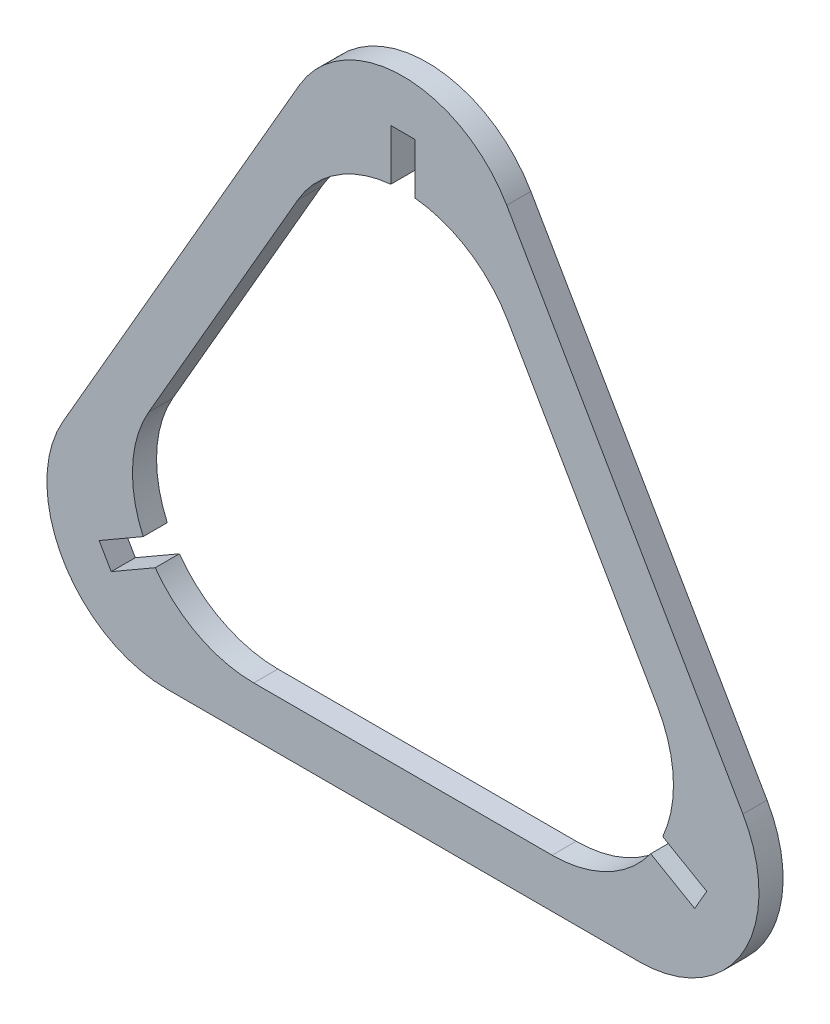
ISO-10303-21;
HEADER;
FILE_DESCRIPTION(('STEP AP214'),'2;1');
FILE_NAME('part.step','',(''),(''),'','','');
FILE_SCHEMA(('AUTOMOTIVE_DESIGN { 1 0 10303 214 1 1 1 1 }'));
ENDSEC;
DATA;
#1=APPLICATION_CONTEXT('core data for automotive mechanical design processes');
#2=APPLICATION_PROTOCOL_DEFINITION('international standard','automotive_design',2000,#1);
#3=PRODUCT_CONTEXT('',#1,'mechanical');
#4=PRODUCT('Part','Part','',(#3));
#5=PRODUCT_RELATED_PRODUCT_CATEGORY('part','',(#4));
#6=PRODUCT_DEFINITION_FORMATION('','',#4);
#7=PRODUCT_DEFINITION_CONTEXT('part definition',#1,'design');
#8=PRODUCT_DEFINITION('design','',#6,#7);
#9=PRODUCT_DEFINITION_SHAPE('','',#8);
#10=(LENGTH_UNIT() NAMED_UNIT(*) SI_UNIT(.MILLI.,.METRE.));
#11=(NAMED_UNIT(*) PLANE_ANGLE_UNIT() SI_UNIT($,.RADIAN.));
#12=(NAMED_UNIT(*) SI_UNIT($,.STERADIAN.) SOLID_ANGLE_UNIT());
#13=UNCERTAINTY_MEASURE_WITH_UNIT(LENGTH_MEASURE(1.E-05),#10,'distance_accuracy_value','');
#14=(GEOMETRIC_REPRESENTATION_CONTEXT(3) GLOBAL_UNCERTAINTY_ASSIGNED_CONTEXT((#13)) GLOBAL_UNIT_ASSIGNED_CONTEXT((#10,
#11,#12)) REPRESENTATION_CONTEXT('',''));
#15=CARTESIAN_POINT('',(0.,0.,0.));
#16=DIRECTION('',(0.,0.,1.));
#17=DIRECTION('',(1.,0.,0.));
#18=AXIS2_PLACEMENT_3D('',#15,#16,#17);
#19=CARTESIAN_POINT('',(24.7372055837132,-14.2820323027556,0.));
#20=DIRECTION('',(0.,0.,1.));
#21=DIRECTION('',(1.,0.,0.));
#22=AXIS2_PLACEMENT_3D('',#19,#20,#21);
#23=CYLINDRICAL_SURFACE('',#22,20.125);
#24=DIRECTION('',(0.,0.,1.));
#25=VECTOR('',#24,1.);
#26=CARTESIAN_POINT('',(43.0796886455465,-22.5626687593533,0.));
#27=LINE('',#26,#25);
#28=CARTESIAN_POINT('',(43.0796886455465,-22.5626687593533,0.));
#29=VERTEX_POINT('',#28);
#30=CARTESIAN_POINT('',(43.0796886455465,-22.5626687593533,4.));
#31=VERTEX_POINT('',#30);
#32=EDGE_CURVE('E227',#29,#31,#27,.T.);
#33=ORIENTED_EDGE('',*,*,#32,.T.);
#34=CARTESIAN_POINT('',(24.7372055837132,-14.2820323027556,4.));
#35=DIRECTION('',(0.,0.,1.));
#36=DIRECTION('',(1.,0.,0.));
#37=AXIS2_PLACEMENT_3D('',#34,#35,#36);
#38=CIRCLE('',#37,20.125);
#39=CARTESIAN_POINT('',(42.165966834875,-4.21953230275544,4.));
#40=VERTEX_POINT('',#39);
#41=EDGE_CURVE('E279',#40,#31,#38,.F.);
#42=ORIENTED_EDGE('',*,*,#41,.F.);
#43=DIRECTION('',(0.,0.,1.));
#44=VECTOR('',#43,1.);
#45=CARTESIAN_POINT('',(42.1659668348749,-4.21953230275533,0.));
#46=LINE('',#45,#44);
#47=CARTESIAN_POINT('',(42.1659668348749,-4.21953230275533,0.));
#48=VERTEX_POINT('',#47);
#49=EDGE_CURVE('E297',#48,#40,#46,.T.);
#50=ORIENTED_EDGE('',*,*,#49,.F.);
#51=CARTESIAN_POINT('',(24.7372055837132,-14.2820323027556,0.));
#52=DIRECTION('',(0.,0.,-1.));
#53=DIRECTION('',(-1.,0.,0.));
#54=AXIS2_PLACEMENT_3D('',#51,#52,#53);
#55=CIRCLE('',#54,20.125);
#56=EDGE_CURVE('E299',#48,#29,#55,.T.);
#57=ORIENTED_EDGE('',*,*,#56,.T.);
#58=EDGE_LOOP('',(#33,#42,#50,#57));
#59=FACE_BOUND('',#58,.T.);
#60=ADVANCED_FACE('F37',(#59),#23,.F.);
#61=CARTESIAN_POINT('',(-24.737205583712,-14.2820323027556,0.));
#62=DIRECTION('',(0.,0.,1.));
#63=DIRECTION('',(1.,0.,0.));
#64=AXIS2_PLACEMENT_3D('',#61,#62,#63);
#65=CYLINDRICAL_SURFACE('',#64,20.125);
#66=CARTESIAN_POINT('',(-24.737205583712,-14.2820323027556,0.));
#67=DIRECTION('',(0.,0.,-1.));
#68=DIRECTION('',(-1.,0.,0.));
#69=AXIS2_PLACEMENT_3D('',#66,#67,#68);
#70=CIRCLE('',#69,20.125);
#71=CARTESIAN_POINT('',(-41.0796886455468,-26.0267703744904,0.));
#72=VERTEX_POINT('',#71);
#73=CARTESIAN_POINT('',(-24.7372055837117,-34.4070323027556,0.));
#74=VERTEX_POINT('',#73);
#75=EDGE_CURVE('E310',#72,#74,#70,.F.);
#76=ORIENTED_EDGE('',*,*,#75,.F.);
#77=DIRECTION('',(0.,0.,1.));
#78=VECTOR('',#77,1.);
#79=CARTESIAN_POINT('',(-41.0796886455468,-26.0267703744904,0.));
#80=LINE('',#79,#78);
#81=CARTESIAN_POINT('',(-41.0796886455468,-26.0267703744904,4.));
#82=VERTEX_POINT('',#81);
#83=EDGE_CURVE('E253',#72,#82,#80,.T.);
#84=ORIENTED_EDGE('',*,*,#83,.T.);
#85=CARTESIAN_POINT('',(-24.737205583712,-14.2820323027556,4.));
#86=DIRECTION('',(0.,0.,1.));
#87=DIRECTION('',(1.,0.,0.));
#88=AXIS2_PLACEMENT_3D('',#85,#86,#87);
#89=CIRCLE('',#88,20.125);
#90=CARTESIAN_POINT('',(-24.7372055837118,-34.4070323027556,4.));
#91=VERTEX_POINT('',#90);
#92=EDGE_CURVE('E291',#82,#91,#89,.T.);
#93=ORIENTED_EDGE('',*,*,#92,.T.);
#94=DIRECTION('',(0.,0.,1.));
#95=VECTOR('',#94,1.);
#96=CARTESIAN_POINT('',(-24.7372055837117,-34.4070323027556,0.));
#97=LINE('',#96,#95);
#98=EDGE_CURVE('E285',#74,#91,#97,.T.);
#99=ORIENTED_EDGE('',*,*,#98,.F.);
#100=EDGE_LOOP('',(#76,#84,#93,#99));
#101=FACE_BOUND('',#100,.T.);
#102=ADVANCED_FACE('F433',(#101),#65,.F.);
#103=CARTESIAN_POINT('',(6.29704621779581E-13,28.5640646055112,0.));
#104=DIRECTION('',(0.,0.,1.));
#105=DIRECTION('',(1.,0.,0.));
#106=AXIS2_PLACEMENT_3D('',#103,#104,#105);
#107=CYLINDRICAL_SURFACE('',#106,20.125);
#108=CARTESIAN_POINT('',(6.29704621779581E-13,28.5640646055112,4.));
#109=DIRECTION('',(0.,0.,1.));
#110=DIRECTION('',(1.,0.,0.));
#111=AXIS2_PLACEMENT_3D('',#108,#109,#110);
#112=CIRCLE('',#111,20.125);
#113=CARTESIAN_POINT('',(17.4287612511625,38.626564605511,4.));
#114=VERTEX_POINT('',#113);
#115=CARTESIAN_POINT('',(2.,48.589439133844,4.));
#116=VERTEX_POINT('',#115);
#117=EDGE_CURVE('E233',#114,#116,#112,.T.);
#118=ORIENTED_EDGE('',*,*,#117,.T.);
#119=DIRECTION('',(0.,0.,1.));
#120=VECTOR('',#119,1.);
#121=CARTESIAN_POINT('',(2.,48.589439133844,0.));
#122=LINE('',#121,#120);
#123=CARTESIAN_POINT('',(2.,48.589439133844,0.));
#124=VERTEX_POINT('',#123);
#125=EDGE_CURVE('E323',#116,#124,#122,.F.);
#126=ORIENTED_EDGE('',*,*,#125,.T.);
#127=CARTESIAN_POINT('',(6.29704621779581E-13,28.5640646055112,0.));
#128=DIRECTION('',(0.,0.,-1.));
#129=DIRECTION('',(-1.,0.,0.));
#130=AXIS2_PLACEMENT_3D('',#127,#128,#129);
#131=CIRCLE('',#130,20.125);
#132=CARTESIAN_POINT('',(17.4287612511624,38.6265646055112,0.));
#133=VERTEX_POINT('',#132);
#134=EDGE_CURVE('E41',#133,#124,#131,.F.);
#135=ORIENTED_EDGE('',*,*,#134,.F.);
#136=DIRECTION('',(0.,0.,1.));
#137=VECTOR('',#136,1.);
#138=CARTESIAN_POINT('',(17.4287612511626,38.6265646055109,0.));
#139=LINE('',#138,#137);
#140=EDGE_CURVE('E319',#133,#114,#139,.T.);
#141=ORIENTED_EDGE('',*,*,#140,.T.);
#142=EDGE_LOOP('',(#118,#126,#135,#141));
#143=FACE_BOUND('',#142,.T.);
#144=ADVANCED_FACE('F406',(#143),#107,.F.);
#145=CARTESIAN_POINT('',(0.,0.,0.));
#146=DIRECTION('',(0.,0.,1.));
#147=DIRECTION('',(1.,0.,0.));
#148=AXIS2_PLACEMENT_3D('',#145,#146,#147);
#149=PLANE('',#148);
#150=DIRECTION('',(-0.5,0.866025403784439,0.));
#151=VECTOR('',#150,1.);
#152=CARTESIAN_POINT('',(56.3832172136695,-12.6778656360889,0.));
#153=LINE('',#152,#151);
#154=CARTESIAN_POINT('',(56.3832172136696,-12.6778656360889,0.));
#155=VERTEX_POINT('',#154);
#156=CARTESIAN_POINT('',(17.2122549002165,55.1682312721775,0.));
#157=VERTEX_POINT('',#156);
#158=EDGE_CURVE('E318',#155,#157,#153,.T.);
#159=ORIENTED_EDGE('',*,*,#158,.F.);
#160=CARTESIAN_POINT('',(39.1709623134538,-22.6153656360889,0.));
#161=DIRECTION('',(0.,0.,-1.));
#162=DIRECTION('',(-1.,0.,0.));
#163=AXIS2_PLACEMENT_3D('',#160,#161,#162);
#164=CIRCLE('',#163,19.875);
#165=CARTESIAN_POINT('',(39.1709623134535,-42.4903656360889,0.));
#166=VERTEX_POINT('',#165);
#167=EDGE_CURVE('E322',#155,#166,#164,.T.);
#168=ORIENTED_EDGE('',*,*,#167,.T.);
#169=DIRECTION('',(1.,0.,0.));
#170=VECTOR('',#169,1.);
#171=CARTESIAN_POINT('',(39.1709623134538,-42.4903656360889,0.));
#172=LINE('',#171,#170);
#173=CARTESIAN_POINT('',(-39.1709623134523,-42.4903656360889,0.));
#174=VERTEX_POINT('',#173);
#175=EDGE_CURVE('E336',#174,#166,#172,.T.);
#176=ORIENTED_EDGE('',*,*,#175,.F.);
#177=CARTESIAN_POINT('',(-39.1709623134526,-22.6153656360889,0.));
#178=DIRECTION('',(0.,0.,-1.));
#179=DIRECTION('',(-1.,0.,0.));
#180=AXIS2_PLACEMENT_3D('',#177,#178,#179);
#181=CIRCLE('',#180,19.875);
#182=CARTESIAN_POINT('',(-56.3832172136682,-12.6778656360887,0.));
#183=VERTEX_POINT('',#182);
#184=EDGE_CURVE('E340',#183,#174,#181,.F.);
#185=ORIENTED_EDGE('',*,*,#184,.F.);
#186=DIRECTION('',(-0.5,-0.866025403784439,0.));
#187=VECTOR('',#186,1.);
#188=CARTESIAN_POINT('',(-36.7977360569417,21.2451828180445,0.));
#189=LINE('',#188,#187);
#190=CARTESIAN_POINT('',(-17.2122549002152,55.1682312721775,0.));
#191=VERTEX_POINT('',#190);
#192=EDGE_CURVE('E344',#191,#183,#189,.T.);
#193=ORIENTED_EDGE('',*,*,#192,.F.);
#194=CARTESIAN_POINT('',(6.20597323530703E-13,45.2307312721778,0.));
#195=DIRECTION('',(0.,0.,-1.));
#196=DIRECTION('',(-1.,0.,0.));
#197=AXIS2_PLACEMENT_3D('',#194,#195,#196);
#198=CIRCLE('',#197,19.875);
#199=EDGE_CURVE('E348',#157,#191,#198,.F.);
#200=ORIENTED_EDGE('',*,*,#199,.F.);
#201=EDGE_LOOP('',(#159,#168,#176,#185,#193,#200));
#202=FACE_BOUND('',#201,.T.);
#203=DIRECTION('',(0.500000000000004,0.866025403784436,0.));
#204=VECTOR('',#203,1.);
#205=CARTESIAN_POINT('',(49.3828451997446,-28.5111989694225,0.));
#206=LINE('',#205,#204);
#207=CARTESIAN_POINT('',(48.3828451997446,-30.2432497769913,0.));
#208=VERTEX_POINT('',#207);
#209=CARTESIAN_POINT('',(50.3828451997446,-26.7791481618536,0.));
#210=VERTEX_POINT('',#209);
#211=EDGE_CURVE('E211',#208,#210,#206,.T.);
#212=ORIENTED_EDGE('',*,*,#211,.T.);
#213=DIRECTION('',(-0.866025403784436,0.500000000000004,0.));
#214=VECTOR('',#213,1.);
#215=CARTESIAN_POINT('',(1.00000000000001,1.73205080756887,0.));
#216=LINE('',#215,#214);
#217=EDGE_CURVE('E230',#210,#29,#216,.T.);
#218=ORIENTED_EDGE('',*,*,#217,.T.);
#219=ORIENTED_EDGE('',*,*,#56,.F.);
#220=DIRECTION('',(-0.5,0.866025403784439,0.));
#221=VECTOR('',#220,1.);
#222=CARTESIAN_POINT('',(42.165966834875,-4.21953230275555,0.));
#223=LINE('',#222,#221);
#224=EDGE_CURVE('E306',#48,#133,#223,.T.);
#225=ORIENTED_EDGE('',*,*,#224,.T.);
#226=ORIENTED_EDGE('',*,*,#134,.T.);
#227=DIRECTION('',(0.,1.,0.));
#228=VECTOR('',#227,1.);
#229=CARTESIAN_POINT('',(2.00000000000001,0.,0.));
#230=LINE('',#229,#228);
#231=CARTESIAN_POINT('',(2.,57.0223979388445,0.));
#232=VERTEX_POINT('',#231);
#233=EDGE_CURVE('E372',#124,#232,#230,.T.);
#234=ORIENTED_EDGE('',*,*,#233,.T.);
#235=DIRECTION('',(-1.,0.,0.));
#236=VECTOR('',#235,1.);
#237=CARTESIAN_POINT('',(0.,57.0223979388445,0.));
#238=LINE('',#237,#236);
#239=CARTESIAN_POINT('',(-2.,57.0223979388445,0.));
#240=VERTEX_POINT('',#239);
#241=EDGE_CURVE('E335',#232,#240,#238,.T.);
#242=ORIENTED_EDGE('',*,*,#241,.T.);
#243=DIRECTION('',(0.,-1.,0.));
#244=VECTOR('',#243,1.);
#245=CARTESIAN_POINT('',(-2.,0.,0.));
#246=LINE('',#245,#244);
#247=CARTESIAN_POINT('',(-2.,48.5894391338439,0.));
#248=VERTEX_POINT('',#247);
#249=EDGE_CURVE('E365',#240,#248,#246,.T.);
#250=ORIENTED_EDGE('',*,*,#249,.T.);
#251=CARTESIAN_POINT('',(-17.4287612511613,38.6265646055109,0.));
#252=VERTEX_POINT('',#251);
#253=EDGE_CURVE('E314',#248,#252,#131,.F.);
#254=ORIENTED_EDGE('',*,*,#253,.T.);
#255=DIRECTION('',(-0.5,-0.866025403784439,0.));
#256=VECTOR('',#255,1.);
#257=CARTESIAN_POINT('',(-29.7973640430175,17.2035161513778,0.));
#258=LINE('',#257,#256);
#259=CARTESIAN_POINT('',(-42.1659668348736,-4.21953230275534,0.));
#260=VERTEX_POINT('',#259);
#261=EDGE_CURVE('E311',#252,#260,#258,.T.);
#262=ORIENTED_EDGE('',*,*,#261,.T.);
#263=CARTESIAN_POINT('',(-43.0796886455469,-22.5626687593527,0.));
#264=VERTEX_POINT('',#263);
#265=EDGE_CURVE('E307',#260,#264,#70,.F.);
#266=ORIENTED_EDGE('',*,*,#265,.T.);
#267=DIRECTION('',(-0.866025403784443,-0.499999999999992,0.));
#268=VECTOR('',#267,1.);
#269=CARTESIAN_POINT('',(-0.999999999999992,1.7320508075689,0.));
#270=LINE('',#269,#268);
#271=CARTESIAN_POINT('',(-50.382845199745,-26.7791481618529,0.));
#272=VERTEX_POINT('',#271);
#273=EDGE_CURVE('E240',#264,#272,#270,.T.);
#274=ORIENTED_EDGE('',*,*,#273,.T.);
#275=DIRECTION('',(0.499999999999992,-0.866025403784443,0.));
#276=VECTOR('',#275,1.);
#277=CARTESIAN_POINT('',(-49.382845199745,-28.5111989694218,0.));
#278=LINE('',#277,#276);
#279=CARTESIAN_POINT('',(-48.382845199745,-30.2432497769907,0.));
#280=VERTEX_POINT('',#279);
#281=EDGE_CURVE('E248',#272,#280,#278,.T.);
#282=ORIENTED_EDGE('',*,*,#281,.T.);
#283=DIRECTION('',(0.866025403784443,0.499999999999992,0.));
#284=VECTOR('',#283,1.);
#285=CARTESIAN_POINT('',(0.999999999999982,-1.73205080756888,0.));
#286=LINE('',#285,#284);
#287=EDGE_CURVE('E256',#280,#72,#286,.T.);
#288=ORIENTED_EDGE('',*,*,#287,.T.);
#289=ORIENTED_EDGE('',*,*,#75,.T.);
#290=DIRECTION('',(1.,0.,0.));
#291=VECTOR('',#290,1.);
#292=CARTESIAN_POINT('',(24.7372055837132,-34.4070323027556,0.));
#293=LINE('',#292,#291);
#294=CARTESIAN_POINT('',(24.7372055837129,-34.4070323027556,0.));
#295=VERTEX_POINT('',#294);
#296=EDGE_CURVE('E303',#74,#295,#293,.T.);
#297=ORIENTED_EDGE('',*,*,#296,.T.);
#298=CARTESIAN_POINT('',(41.0796886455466,-26.0267703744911,0.));
#299=VERTEX_POINT('',#298);
#300=EDGE_CURVE('E302',#299,#295,#55,.T.);
#301=ORIENTED_EDGE('',*,*,#300,.F.);
#302=DIRECTION('',(0.866025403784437,-0.500000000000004,0.));
#303=VECTOR('',#302,1.);
#304=CARTESIAN_POINT('',(-1.00000000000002,-1.73205080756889,0.));
#305=LINE('',#304,#303);
#306=EDGE_CURVE('E213',#299,#208,#305,.T.);
#307=ORIENTED_EDGE('',*,*,#306,.T.);
#308=EDGE_LOOP('',(#212,#218,#219,#225,#226,#234,#242,#250,#254,#262,#266,#274,#282,#288,#289,
#297,#301,#307));
#309=FACE_BOUND('',#308,.T.);
#310=ADVANCED_FACE('F39',(#202,#309),#149,.F.);
#311=DIRECTION('',(0.,0.,1.));
#312=VECTOR('',#311,1.);
#313=CARTESIAN_POINT('',(41.0796886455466,-26.0267703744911,0.));
#314=LINE('',#313,#312);
#315=CARTESIAN_POINT('',(41.0796886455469,-26.0267703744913,4.));
#316=VERTEX_POINT('',#315);
#317=EDGE_CURVE('E62',#316,#299,#314,.F.);
#318=ORIENTED_EDGE('',*,*,#317,.T.);
#319=ORIENTED_EDGE('',*,*,#300,.T.);
#320=DIRECTION('',(0.,0.,1.));
#321=VECTOR('',#320,1.);
#322=CARTESIAN_POINT('',(24.7372055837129,-34.4070323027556,0.));
#323=LINE('',#322,#321);
#324=CARTESIAN_POINT('',(24.7372055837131,-34.4070323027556,4.));
#325=VERTEX_POINT('',#324);
#326=EDGE_CURVE('E286',#295,#325,#323,.T.);
#327=ORIENTED_EDGE('',*,*,#326,.T.);
#328=EDGE_CURVE('E281',#316,#325,#38,.F.);
#329=ORIENTED_EDGE('',*,*,#328,.F.);
#330=EDGE_LOOP('',(#318,#319,#327,#329));
#331=FACE_BOUND('',#330,.T.);
#332=ADVANCED_FACE('F436',(#331),#23,.F.);
#333=CARTESIAN_POINT('',(24.7372055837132,-34.4070323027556,0.));
#334=DIRECTION('',(0.,-1.,0.));
#335=DIRECTION('',(1.,0.,0.));
#336=AXIS2_PLACEMENT_3D('',#333,#334,#335);
#337=PLANE('',#336);
#338=DIRECTION('',(1.,0.,0.));
#339=VECTOR('',#338,1.);
#340=CARTESIAN_POINT('',(24.7372055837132,-34.4070323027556,4.));
#341=LINE('',#340,#339);
#342=EDGE_CURVE('E282',#91,#325,#341,.T.);
#343=ORIENTED_EDGE('',*,*,#342,.T.);
#344=ORIENTED_EDGE('',*,*,#326,.F.);
#345=ORIENTED_EDGE('',*,*,#296,.F.);
#346=ORIENTED_EDGE('',*,*,#98,.T.);
#347=EDGE_LOOP('',(#343,#344,#345,#346));
#348=FACE_BOUND('',#347,.T.);
#349=ADVANCED_FACE('F445',(#348),#337,.F.);
#350=CARTESIAN_POINT('',(-42.1659668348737,-4.21953230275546,4.));
#351=VERTEX_POINT('',#350);
#352=CARTESIAN_POINT('',(-43.0796886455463,-22.5626687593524,4.));
#353=VERTEX_POINT('',#352);
#354=EDGE_CURVE('E287',#351,#353,#89,.T.);
#355=ORIENTED_EDGE('',*,*,#354,.T.);
#356=DIRECTION('',(0.,0.,1.));
#357=VECTOR('',#356,1.);
#358=CARTESIAN_POINT('',(-43.0796886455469,-22.5626687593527,0.));
#359=LINE('',#358,#357);
#360=EDGE_CURVE('E54',#353,#264,#359,.F.);
#361=ORIENTED_EDGE('',*,*,#360,.T.);
#362=ORIENTED_EDGE('',*,*,#265,.F.);
#363=DIRECTION('',(0.,0.,1.));
#364=VECTOR('',#363,1.);
#365=CARTESIAN_POINT('',(-42.1659668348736,-4.21953230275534,0.));
#366=LINE('',#365,#364);
#367=EDGE_CURVE('E290',#260,#351,#366,.T.);
#368=ORIENTED_EDGE('',*,*,#367,.T.);
#369=EDGE_LOOP('',(#355,#361,#362,#368));
#370=FACE_BOUND('',#369,.T.);
#371=ADVANCED_FACE('F399',(#370),#65,.F.);
#372=CARTESIAN_POINT('',(-29.7973640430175,17.2035161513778,0.));
#373=DIRECTION('',(-0.866025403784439,0.5,0.));
#374=DIRECTION('',(-0.5,-0.866025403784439,0.));
#375=AXIS2_PLACEMENT_3D('',#372,#373,#374);
#376=PLANE('',#375);
#377=DIRECTION('',(-0.5,-0.866025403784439,0.));
#378=VECTOR('',#377,1.);
#379=CARTESIAN_POINT('',(-29.7973640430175,17.2035161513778,4.));
#380=LINE('',#379,#378);
#381=CARTESIAN_POINT('',(-17.4287612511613,38.626564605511,4.));
#382=VERTEX_POINT('',#381);
#383=EDGE_CURVE('E292',#382,#351,#380,.T.);
#384=ORIENTED_EDGE('',*,*,#383,.T.);
#385=ORIENTED_EDGE('',*,*,#367,.F.);
#386=ORIENTED_EDGE('',*,*,#261,.F.);
#387=DIRECTION('',(0.,0.,1.));
#388=VECTOR('',#387,1.);
#389=CARTESIAN_POINT('',(-17.4287612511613,38.6265646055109,0.));
#390=LINE('',#389,#388);
#391=EDGE_CURVE('E294',#252,#382,#390,.T.);
#392=ORIENTED_EDGE('',*,*,#391,.T.);
#393=EDGE_LOOP('',(#384,#385,#386,#392));
#394=FACE_BOUND('',#393,.T.);
#395=ADVANCED_FACE('F395',(#394),#376,.F.);
#396=ORIENTED_EDGE('',*,*,#253,.F.);
#397=DIRECTION('',(0.,0.,1.));
#398=VECTOR('',#397,1.);
#399=CARTESIAN_POINT('',(-2.,48.5894391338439,0.));
#400=LINE('',#399,#398);
#401=CARTESIAN_POINT('',(-2.,48.5894391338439,4.));
#402=VERTEX_POINT('',#401);
#403=EDGE_CURVE('E326',#248,#402,#400,.T.);
#404=ORIENTED_EDGE('',*,*,#403,.T.);
#405=EDGE_CURVE('E298',#402,#382,#112,.T.);
#406=ORIENTED_EDGE('',*,*,#405,.T.);
#407=ORIENTED_EDGE('',*,*,#391,.F.);
#408=EDGE_LOOP('',(#396,#404,#406,#407));
#409=FACE_BOUND('',#408,.T.);
#410=ADVANCED_FACE('F390',(#409),#107,.F.);
#411=CARTESIAN_POINT('',(42.165966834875,-4.21953230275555,0.));
#412=DIRECTION('',(0.866025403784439,0.5,0.));
#413=DIRECTION('',(-0.5,0.866025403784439,0.));
#414=AXIS2_PLACEMENT_3D('',#411,#412,#413);
#415=PLANE('',#414);
#416=DIRECTION('',(-0.5,0.866025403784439,0.));
#417=VECTOR('',#416,1.);
#418=CARTESIAN_POINT('',(42.165966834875,-4.21953230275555,4.));
#419=LINE('',#418,#417);
#420=EDGE_CURVE('E295',#40,#114,#419,.T.);
#421=ORIENTED_EDGE('',*,*,#420,.T.);
#422=ORIENTED_EDGE('',*,*,#140,.F.);
#423=ORIENTED_EDGE('',*,*,#224,.F.);
#424=ORIENTED_EDGE('',*,*,#49,.T.);
#425=EDGE_LOOP('',(#421,#422,#423,#424));
#426=FACE_BOUND('',#425,.T.);
#427=ADVANCED_FACE('F408',(#426),#415,.F.);
#428=CARTESIAN_POINT('',(56.3832172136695,-12.6778656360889,0.));
#429=DIRECTION('',(0.866025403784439,0.5,0.));
#430=DIRECTION('',(-0.5,0.866025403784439,0.));
#431=AXIS2_PLACEMENT_3D('',#428,#429,#430);
#432=PLANE('',#431);
#433=DIRECTION('',(0.,0.,1.));
#434=VECTOR('',#433,1.);
#435=CARTESIAN_POINT('',(56.3832172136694,-12.6778656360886,0.));
#436=LINE('',#435,#434);
#437=CARTESIAN_POINT('',(56.3832172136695,-12.6778656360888,4.));
#438=VERTEX_POINT('',#437);
#439=EDGE_CURVE('E261',#155,#438,#436,.T.);
#440=ORIENTED_EDGE('',*,*,#439,.F.);
#441=ORIENTED_EDGE('',*,*,#158,.T.);
#442=DIRECTION('',(0.,0.,1.));
#443=VECTOR('',#442,1.);
#444=CARTESIAN_POINT('',(17.2122549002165,55.1682312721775,0.));
#445=LINE('',#444,#443);
#446=CARTESIAN_POINT('',(17.2122549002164,55.1682312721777,4.));
#447=VERTEX_POINT('',#446);
#448=EDGE_CURVE('E351',#157,#447,#445,.T.);
#449=ORIENTED_EDGE('',*,*,#448,.T.);
#450=DIRECTION('',(-0.5,0.866025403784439,0.));
#451=VECTOR('',#450,1.);
#452=CARTESIAN_POINT('',(56.3832172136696,-12.6778656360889,4.));
#453=LINE('',#452,#451);
#454=EDGE_CURVE('E276',#438,#447,#453,.T.);
#455=ORIENTED_EDGE('',*,*,#454,.F.);
#456=EDGE_LOOP('',(#440,#441,#449,#455));
#457=FACE_BOUND('',#456,.T.);
#458=ADVANCED_FACE('F485',(#457),#432,.T.);
#459=CARTESIAN_POINT('',(6.20597323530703E-13,45.2307312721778,0.));
#460=DIRECTION('',(0.,0.,1.));
#461=DIRECTION('',(1.,0.,0.));
#462=AXIS2_PLACEMENT_3D('',#459,#460,#461);
#463=CYLINDRICAL_SURFACE('',#462,19.875);
#464=ORIENTED_EDGE('',*,*,#448,.F.);
#465=ORIENTED_EDGE('',*,*,#199,.T.);
#466=DIRECTION('',(0.,0.,1.));
#467=VECTOR('',#466,1.);
#468=CARTESIAN_POINT('',(-17.2122549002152,55.1682312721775,0.));
#469=LINE('',#468,#467);
#470=CARTESIAN_POINT('',(-17.2122549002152,55.1682312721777,4.));
#471=VERTEX_POINT('',#470);
#472=EDGE_CURVE('E347',#191,#471,#469,.T.);
#473=ORIENTED_EDGE('',*,*,#472,.T.);
#474=CARTESIAN_POINT('',(6.20597323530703E-13,45.2307312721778,4.));
#475=DIRECTION('',(0.,0.,1.));
#476=DIRECTION('',(1.,0.,0.));
#477=AXIS2_PLACEMENT_3D('',#474,#475,#476);
#478=CIRCLE('',#477,19.875);
#479=EDGE_CURVE('E273',#447,#471,#478,.T.);
#480=ORIENTED_EDGE('',*,*,#479,.F.);
#481=EDGE_LOOP('',(#464,#465,#473,#480));
#482=FACE_BOUND('',#481,.T.);
#483=ADVANCED_FACE('F515',(#482),#463,.T.);
#484=CARTESIAN_POINT('',(-36.7977360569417,21.2451828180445,0.));
#485=DIRECTION('',(-0.866025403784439,0.5,0.));
#486=DIRECTION('',(-0.5,-0.866025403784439,0.));
#487=AXIS2_PLACEMENT_3D('',#484,#485,#486);
#488=PLANE('',#487);
#489=ORIENTED_EDGE('',*,*,#472,.F.);
#490=ORIENTED_EDGE('',*,*,#192,.T.);
#491=DIRECTION('',(0.,0.,1.));
#492=VECTOR('',#491,1.);
#493=CARTESIAN_POINT('',(-56.3832172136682,-12.6778656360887,0.));
#494=LINE('',#493,#492);
#495=CARTESIAN_POINT('',(-56.3832172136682,-12.6778656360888,4.));
#496=VERTEX_POINT('',#495);
#497=EDGE_CURVE('E343',#183,#496,#494,.T.);
#498=ORIENTED_EDGE('',*,*,#497,.T.);
#499=DIRECTION('',(-0.5,-0.866025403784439,0.));
#500=VECTOR('',#499,1.);
#501=CARTESIAN_POINT('',(-17.2122549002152,55.1682312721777,4.));
#502=LINE('',#501,#500);
#503=EDGE_CURVE('E270',#471,#496,#502,.T.);
#504=ORIENTED_EDGE('',*,*,#503,.F.);
#505=EDGE_LOOP('',(#489,#490,#498,#504));
#506=FACE_BOUND('',#505,.T.);
#507=ADVANCED_FACE('F523',(#506),#488,.T.);
#508=CARTESIAN_POINT('',(-39.1709623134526,-22.6153656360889,0.));
#509=DIRECTION('',(0.,0.,1.));
#510=DIRECTION('',(1.,0.,0.));
#511=AXIS2_PLACEMENT_3D('',#508,#509,#510);
#512=CYLINDRICAL_SURFACE('',#511,19.875);
#513=ORIENTED_EDGE('',*,*,#497,.F.);
#514=ORIENTED_EDGE('',*,*,#184,.T.);
#515=DIRECTION('',(0.,0.,1.));
#516=VECTOR('',#515,1.);
#517=CARTESIAN_POINT('',(-39.1709623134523,-42.4903656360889,0.));
#518=LINE('',#517,#516);
#519=CARTESIAN_POINT('',(-39.1709623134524,-42.4903656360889,4.));
#520=VERTEX_POINT('',#519);
#521=EDGE_CURVE('E339',#174,#520,#518,.T.);
#522=ORIENTED_EDGE('',*,*,#521,.T.);
#523=CARTESIAN_POINT('',(-39.1709623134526,-22.6153656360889,4.));
#524=DIRECTION('',(0.,0.,1.));
#525=DIRECTION('',(1.,0.,0.));
#526=AXIS2_PLACEMENT_3D('',#523,#524,#525);
#527=CIRCLE('',#526,19.875);
#528=EDGE_CURVE('E267',#496,#520,#527,.T.);
#529=ORIENTED_EDGE('',*,*,#528,.F.);
#530=EDGE_LOOP('',(#513,#514,#522,#529));
#531=FACE_BOUND('',#530,.T.);
#532=ADVANCED_FACE('F532',(#531),#512,.T.);
#533=CARTESIAN_POINT('',(39.1709623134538,-42.4903656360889,0.));
#534=DIRECTION('',(0.,-1.,0.));
#535=DIRECTION('',(1.,0.,0.));
#536=AXIS2_PLACEMENT_3D('',#533,#534,#535);
#537=PLANE('',#536);
#538=ORIENTED_EDGE('',*,*,#521,.F.);
#539=ORIENTED_EDGE('',*,*,#175,.T.);
#540=DIRECTION('',(0.,0.,1.));
#541=VECTOR('',#540,1.);
#542=CARTESIAN_POINT('',(39.1709623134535,-42.4903656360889,0.));
#543=LINE('',#542,#541);
#544=CARTESIAN_POINT('',(39.1709623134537,-42.4903656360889,4.));
#545=VERTEX_POINT('',#544);
#546=EDGE_CURVE('E262',#166,#545,#543,.T.);
#547=ORIENTED_EDGE('',*,*,#546,.T.);
#548=DIRECTION('',(1.,0.,0.));
#549=VECTOR('',#548,1.);
#550=CARTESIAN_POINT('',(0.,-42.4903656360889,4.));
#551=LINE('',#550,#549);
#552=EDGE_CURVE('E263',#520,#545,#551,.T.);
#553=ORIENTED_EDGE('',*,*,#552,.F.);
#554=EDGE_LOOP('',(#538,#539,#547,#553));
#555=FACE_BOUND('',#554,.T.);
#556=ADVANCED_FACE('F541',(#555),#537,.T.);
#557=CARTESIAN_POINT('',(39.1709623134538,-22.6153656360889,0.));
#558=DIRECTION('',(0.,0.,1.));
#559=DIRECTION('',(1.,0.,0.));
#560=AXIS2_PLACEMENT_3D('',#557,#558,#559);
#561=CYLINDRICAL_SURFACE('',#560,19.875);
#562=CARTESIAN_POINT('',(39.1709623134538,-22.6153656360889,4.));
#563=DIRECTION('',(0.,0.,1.));
#564=DIRECTION('',(1.,0.,0.));
#565=AXIS2_PLACEMENT_3D('',#562,#563,#564);
#566=CIRCLE('',#565,19.875);
#567=EDGE_CURVE('E259',#438,#545,#566,.F.);
#568=ORIENTED_EDGE('',*,*,#567,.T.);
#569=ORIENTED_EDGE('',*,*,#546,.F.);
#570=ORIENTED_EDGE('',*,*,#167,.F.);
#571=ORIENTED_EDGE('',*,*,#439,.T.);
#572=EDGE_LOOP('',(#568,#569,#570,#571));
#573=FACE_BOUND('',#572,.T.);
#574=ADVANCED_FACE('F428',(#573),#561,.T.);
#575=CARTESIAN_POINT('',(0.,0.,4.));
#576=DIRECTION('',(0.,0.,1.));
#577=DIRECTION('',(1.,0.,0.));
#578=AXIS2_PLACEMENT_3D('',#575,#576,#577);
#579=PLANE('',#578);
#580=DIRECTION('',(-0.866025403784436,0.500000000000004,0.));
#581=VECTOR('',#580,1.);
#582=CARTESIAN_POINT('',(50.2745920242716,-26.7166481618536,4.));
#583=LINE('',#582,#581);
#584=CARTESIAN_POINT('',(50.3828451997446,-26.7791481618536,4.));
#585=VERTEX_POINT('',#584);
#586=EDGE_CURVE('E219',#585,#31,#583,.T.);
#587=ORIENTED_EDGE('',*,*,#586,.F.);
#588=DIRECTION('',(-0.500000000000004,-0.866025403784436,0.));
#589=VECTOR('',#588,1.);
#590=CARTESIAN_POINT('',(50.3203451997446,-26.8874013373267,4.));
#591=LINE('',#590,#589);
#592=CARTESIAN_POINT('',(48.3828451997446,-30.2432497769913,4.));
#593=VERTEX_POINT('',#592);
#594=EDGE_CURVE('E208',#593,#585,#591,.F.);
#595=ORIENTED_EDGE('',*,*,#594,.F.);
#596=DIRECTION('',(0.866025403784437,-0.500000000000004,0.));
#597=VECTOR('',#596,1.);
#598=CARTESIAN_POINT('',(-1.00000000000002,-1.73205080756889,4.));
#599=LINE('',#598,#597);
#600=EDGE_CURVE('E197',#316,#593,#599,.T.);
#601=ORIENTED_EDGE('',*,*,#600,.F.);
#602=ORIENTED_EDGE('',*,*,#328,.T.);
#603=ORIENTED_EDGE('',*,*,#342,.F.);
#604=ORIENTED_EDGE('',*,*,#92,.F.);
#605=DIRECTION('',(0.866025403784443,0.499999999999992,0.));
#606=VECTOR('',#605,1.);
#607=CARTESIAN_POINT('',(-48.2745920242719,-30.1807497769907,4.));
#608=LINE('',#607,#606);
#609=CARTESIAN_POINT('',(-48.382845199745,-30.2432497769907,4.));
#610=VERTEX_POINT('',#609);
#611=EDGE_CURVE('E251',#610,#82,#608,.T.);
#612=ORIENTED_EDGE('',*,*,#611,.F.);
#613=DIRECTION('',(-0.499999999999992,0.866025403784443,0.));
#614=VECTOR('',#613,1.);
#615=CARTESIAN_POINT('',(-48.445345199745,-30.1349966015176,4.));
#616=LINE('',#615,#614);
#617=CARTESIAN_POINT('',(-50.382845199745,-26.7791481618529,4.));
#618=VERTEX_POINT('',#617);
#619=EDGE_CURVE('E243',#618,#610,#616,.F.);
#620=ORIENTED_EDGE('',*,*,#619,.F.);
#621=DIRECTION('',(-0.866025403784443,-0.499999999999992,0.));
#622=VECTOR('',#621,1.);
#623=CARTESIAN_POINT('',(-0.999999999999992,1.7320508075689,4.));
#624=LINE('',#623,#622);
#625=EDGE_CURVE('E235',#353,#618,#624,.T.);
#626=ORIENTED_EDGE('',*,*,#625,.F.);
#627=ORIENTED_EDGE('',*,*,#354,.F.);
#628=ORIENTED_EDGE('',*,*,#383,.F.);
#629=ORIENTED_EDGE('',*,*,#405,.F.);
#630=DIRECTION('',(0.,-1.,0.));
#631=VECTOR('',#630,1.);
#632=CARTESIAN_POINT('',(-2.,56.8973979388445,4.));
#633=LINE('',#632,#631);
#634=CARTESIAN_POINT('',(-2.,57.0223979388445,4.));
#635=VERTEX_POINT('',#634);
#636=EDGE_CURVE('E379',#635,#402,#633,.T.);
#637=ORIENTED_EDGE('',*,*,#636,.F.);
#638=DIRECTION('',(1.,0.,0.));
#639=VECTOR('',#638,1.);
#640=CARTESIAN_POINT('',(-1.875,57.0223979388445,4.));
#641=LINE('',#640,#639);
#642=CARTESIAN_POINT('',(2.,57.0223979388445,4.));
#643=VERTEX_POINT('',#642);
#644=EDGE_CURVE('E46',#643,#635,#641,.F.);
#645=ORIENTED_EDGE('',*,*,#644,.F.);
#646=DIRECTION('',(0.,1.,0.));
#647=VECTOR('',#646,1.);
#648=CARTESIAN_POINT('',(2.00000000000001,0.,4.));
#649=LINE('',#648,#647);
#650=EDGE_CURVE('E11',#116,#643,#649,.T.);
#651=ORIENTED_EDGE('',*,*,#650,.F.);
#652=ORIENTED_EDGE('',*,*,#117,.F.);
#653=ORIENTED_EDGE('',*,*,#420,.F.);
#654=ORIENTED_EDGE('',*,*,#41,.T.);
#655=EDGE_LOOP('',(#587,#595,#601,#602,#603,#604,#612,#620,#626,#627,#628,#629,#637,#645,#651,
#652,#653,#654));
#656=FACE_BOUND('',#655,.T.);
#657=ORIENTED_EDGE('',*,*,#567,.F.);
#658=ORIENTED_EDGE('',*,*,#454,.T.);
#659=ORIENTED_EDGE('',*,*,#479,.T.);
#660=ORIENTED_EDGE('',*,*,#503,.T.);
#661=ORIENTED_EDGE('',*,*,#528,.T.);
#662=ORIENTED_EDGE('',*,*,#552,.T.);
#663=EDGE_LOOP('',(#657,#658,#659,#660,#661,#662));
#664=FACE_BOUND('',#663,.T.);
#665=ADVANCED_FACE('F216',(#656,#664),#579,.T.);
#666=CARTESIAN_POINT('',(-2.,56.8973979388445,-6.));
#667=DIRECTION('',(-1.,0.,0.));
#668=DIRECTION('',(0.,-1.,0.));
#669=AXIS2_PLACEMENT_3D('',#666,#667,#668);
#670=PLANE('',#669);
#671=DIRECTION('',(0.,0.,1.));
#672=VECTOR('',#671,1.);
#673=CARTESIAN_POINT('',(-2.,57.0223979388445,-6.));
#674=LINE('',#673,#672);
#675=EDGE_CURVE('E266',#240,#635,#674,.T.);
#676=ORIENTED_EDGE('',*,*,#675,.T.);
#677=ORIENTED_EDGE('',*,*,#636,.T.);
#678=ORIENTED_EDGE('',*,*,#403,.F.);
#679=ORIENTED_EDGE('',*,*,#249,.F.);
#680=EDGE_LOOP('',(#676,#677,#678,#679));
#681=FACE_BOUND('',#680,.T.);
#682=ADVANCED_FACE('F420',(#681),#670,.F.);
#683=CARTESIAN_POINT('',(-1.875,57.0223979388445,-6.));
#684=DIRECTION('',(0.,1.,0.));
#685=DIRECTION('',(0.,0.,1.));
#686=AXIS2_PLACEMENT_3D('',#683,#684,#685);
#687=PLANE('',#686);
#688=DIRECTION('',(0.,0.,1.));
#689=VECTOR('',#688,1.);
#690=CARTESIAN_POINT('',(2.,57.0223979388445,-6.));
#691=LINE('',#690,#689);
#692=EDGE_CURVE('E377',#232,#643,#691,.T.);
#693=ORIENTED_EDGE('',*,*,#692,.T.);
#694=ORIENTED_EDGE('',*,*,#644,.T.);
#695=ORIENTED_EDGE('',*,*,#675,.F.);
#696=ORIENTED_EDGE('',*,*,#241,.F.);
#697=EDGE_LOOP('',(#693,#694,#695,#696));
#698=FACE_BOUND('',#697,.T.);
#699=ADVANCED_FACE('F417',(#698),#687,.F.);
#700=CARTESIAN_POINT('',(2.,56.8973979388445,-6.));
#701=DIRECTION('',(1.,0.,0.));
#702=DIRECTION('',(0.,1.,0.));
#703=AXIS2_PLACEMENT_3D('',#700,#701,#702);
#704=PLANE('',#703);
#705=ORIENTED_EDGE('',*,*,#125,.F.);
#706=ORIENTED_EDGE('',*,*,#650,.T.);
#707=ORIENTED_EDGE('',*,*,#692,.F.);
#708=ORIENTED_EDGE('',*,*,#233,.F.);
#709=EDGE_LOOP('',(#705,#706,#707,#708));
#710=FACE_BOUND('',#709,.T.);
#711=ADVANCED_FACE('F415',(#710),#704,.F.);
#712=CARTESIAN_POINT('',(-48.2745920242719,-30.1807497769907,-6.));
#713=DIRECTION('',(0.499999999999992,-0.866025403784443,0.));
#714=DIRECTION('',(0.866025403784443,0.499999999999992,0.));
#715=AXIS2_PLACEMENT_3D('',#712,#713,#714);
#716=PLANE('',#715);
#717=DIRECTION('',(0.,0.,1.));
#718=VECTOR('',#717,1.);
#719=CARTESIAN_POINT('',(-48.382845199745,-30.2432497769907,-6.));
#720=LINE('',#719,#718);
#721=EDGE_CURVE('E245',#280,#610,#720,.T.);
#722=ORIENTED_EDGE('',*,*,#721,.T.);
#723=ORIENTED_EDGE('',*,*,#611,.T.);
#724=ORIENTED_EDGE('',*,*,#83,.F.);
#725=ORIENTED_EDGE('',*,*,#287,.F.);
#726=EDGE_LOOP('',(#722,#723,#724,#725));
#727=FACE_BOUND('',#726,.T.);
#728=ADVANCED_FACE('F464',(#727),#716,.F.);
#729=CARTESIAN_POINT('',(-48.445345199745,-30.1349966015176,-6.));
#730=DIRECTION('',(-0.866025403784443,-0.499999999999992,0.));
#731=DIRECTION('',(0.,0.,1.));
#732=AXIS2_PLACEMENT_3D('',#729,#730,#731);
#733=PLANE('',#732);
#734=DIRECTION('',(0.,0.,1.));
#735=VECTOR('',#734,1.);
#736=CARTESIAN_POINT('',(-50.382845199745,-26.7791481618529,-6.));
#737=LINE('',#736,#735);
#738=EDGE_CURVE('E237',#272,#618,#737,.T.);
#739=ORIENTED_EDGE('',*,*,#738,.T.);
#740=ORIENTED_EDGE('',*,*,#619,.T.);
#741=ORIENTED_EDGE('',*,*,#721,.F.);
#742=ORIENTED_EDGE('',*,*,#281,.F.);
#743=EDGE_LOOP('',(#739,#740,#741,#742));
#744=FACE_BOUND('',#743,.T.);
#745=ADVANCED_FACE('F467',(#744),#733,.F.);
#746=CARTESIAN_POINT('',(-50.2745920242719,-26.7166481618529,-6.));
#747=DIRECTION('',(-0.499999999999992,0.866025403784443,0.));
#748=DIRECTION('',(-0.866025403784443,-0.499999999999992,0.));
#749=AXIS2_PLACEMENT_3D('',#746,#747,#748);
#750=PLANE('',#749);
#751=ORIENTED_EDGE('',*,*,#360,.F.);
#752=ORIENTED_EDGE('',*,*,#625,.T.);
#753=ORIENTED_EDGE('',*,*,#738,.F.);
#754=ORIENTED_EDGE('',*,*,#273,.F.);
#755=EDGE_LOOP('',(#751,#752,#753,#754));
#756=FACE_BOUND('',#755,.T.);
#757=ADVANCED_FACE('F468',(#756),#750,.F.);
#758=CARTESIAN_POINT('',(50.2745920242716,-26.7166481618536,-6.));
#759=DIRECTION('',(0.500000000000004,0.866025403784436,0.));
#760=DIRECTION('',(-0.866025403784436,0.500000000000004,0.));
#761=AXIS2_PLACEMENT_3D('',#758,#759,#760);
#762=PLANE('',#761);
#763=DIRECTION('',(0.,0.,1.));
#764=VECTOR('',#763,1.);
#765=CARTESIAN_POINT('',(50.3828451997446,-26.7791481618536,-6.));
#766=LINE('',#765,#764);
#767=EDGE_CURVE('E220',#210,#585,#766,.T.);
#768=ORIENTED_EDGE('',*,*,#767,.T.);
#769=ORIENTED_EDGE('',*,*,#586,.T.);
#770=ORIENTED_EDGE('',*,*,#32,.F.);
#771=ORIENTED_EDGE('',*,*,#217,.F.);
#772=EDGE_LOOP('',(#768,#769,#770,#771));
#773=FACE_BOUND('',#772,.T.);
#774=ADVANCED_FACE('F470',(#773),#762,.F.);
#775=CARTESIAN_POINT('',(50.3203451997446,-26.8874013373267,-6.));
#776=DIRECTION('',(0.866025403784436,-0.500000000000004,0.));
#777=DIRECTION('',(0.,0.,1.));
#778=AXIS2_PLACEMENT_3D('',#775,#776,#777);
#779=PLANE('',#778);
#780=DIRECTION('',(0.,0.,1.));
#781=VECTOR('',#780,1.);
#782=CARTESIAN_POINT('',(48.3828451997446,-30.2432497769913,-6.));
#783=LINE('',#782,#781);
#784=EDGE_CURVE('E200',#208,#593,#783,.T.);
#785=ORIENTED_EDGE('',*,*,#784,.T.);
#786=ORIENTED_EDGE('',*,*,#594,.T.);
#787=ORIENTED_EDGE('',*,*,#767,.F.);
#788=ORIENTED_EDGE('',*,*,#211,.F.);
#789=EDGE_LOOP('',(#785,#786,#787,#788));
#790=FACE_BOUND('',#789,.T.);
#791=ADVANCED_FACE('F207',(#790),#779,.F.);
#792=CARTESIAN_POINT('',(48.2745920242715,-30.1807497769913,-6.));
#793=DIRECTION('',(-0.500000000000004,-0.866025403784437,0.));
#794=DIRECTION('',(0.866025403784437,-0.500000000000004,0.));
#795=AXIS2_PLACEMENT_3D('',#792,#793,#794);
#796=PLANE('',#795);
#797=ORIENTED_EDGE('',*,*,#317,.F.);
#798=ORIENTED_EDGE('',*,*,#600,.T.);
#799=ORIENTED_EDGE('',*,*,#784,.F.);
#800=ORIENTED_EDGE('',*,*,#306,.F.);
#801=EDGE_LOOP('',(#797,#798,#799,#800));
#802=FACE_BOUND('',#801,.T.);
#803=ADVANCED_FACE('F199',(#802),#796,.F.);
#804=CLOSED_SHELL('',(#60,#102,#144,#310,#332,#349,#371,#395,#410,#427,#458,#483,#507,#532,#556,
#574,#665,#682,#699,#711,#728,#745,#757,#774,#791,#803));
#805=MANIFOLD_SOLID_BREP('B2',#804);
#806=ADVANCED_BREP_SHAPE_REPRESENTATION('',(#18,#805),#14);
#807=SHAPE_DEFINITION_REPRESENTATION(#9,#806);
ENDSEC;
END-ISO-10303-21;
